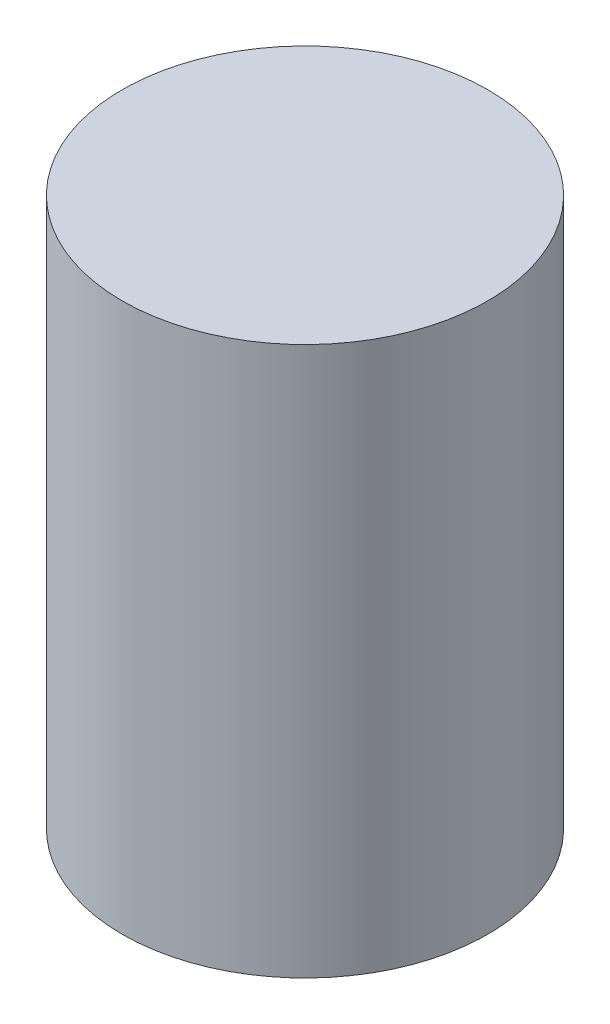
from build123d import *

# Parameters (mm, degrees)
SKETCH1_R           = 6.35
BOSS_EXTRUDE1_DEPTH = 19.05
SKETCH2_R           = 3.175
CUT_EXTRUDE1_DEPTH  = 15.875
SKETCH3_R           = 1.27
CUT_EXTRUDE2_DEPTH  = 22.060567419


with BuildPart() as part:
    # Sketch1 → Boss-Extrude1 (new body)
    with BuildSketch(Plane(origin=(0, 0, 0), x_dir=(1, 0, 0), z_dir=(0, 1, 0))):
        with Locations(Location((0, 0, 0), (0, 0, 90))):
            Circle(SKETCH1_R)
    extrude(amount=BOSS_EXTRUDE1_DEPTH)

    # Sketch2 → Cut-Extrude1 (cut)
    with BuildSketch(Plane.XZ):
        with Locations(Location((0, 0, 0), (0, 0, 270))):
            Circle(SKETCH2_R)
    extrude(amount=-CUT_EXTRUDE1_DEPTH, mode=Mode.SUBTRACT)

    # Sketch3 → Cut-Extrude2 (cut, through all)
    with BuildSketch(Plane.XY):
        with Locations(Location((0, 3.81, 0), (0, 0, 90))):
            Circle(SKETCH3_R)
    extrude(amount=-CUT_EXTRUDE2_DEPTH, mode=Mode.SUBTRACT)


solid = part.part
